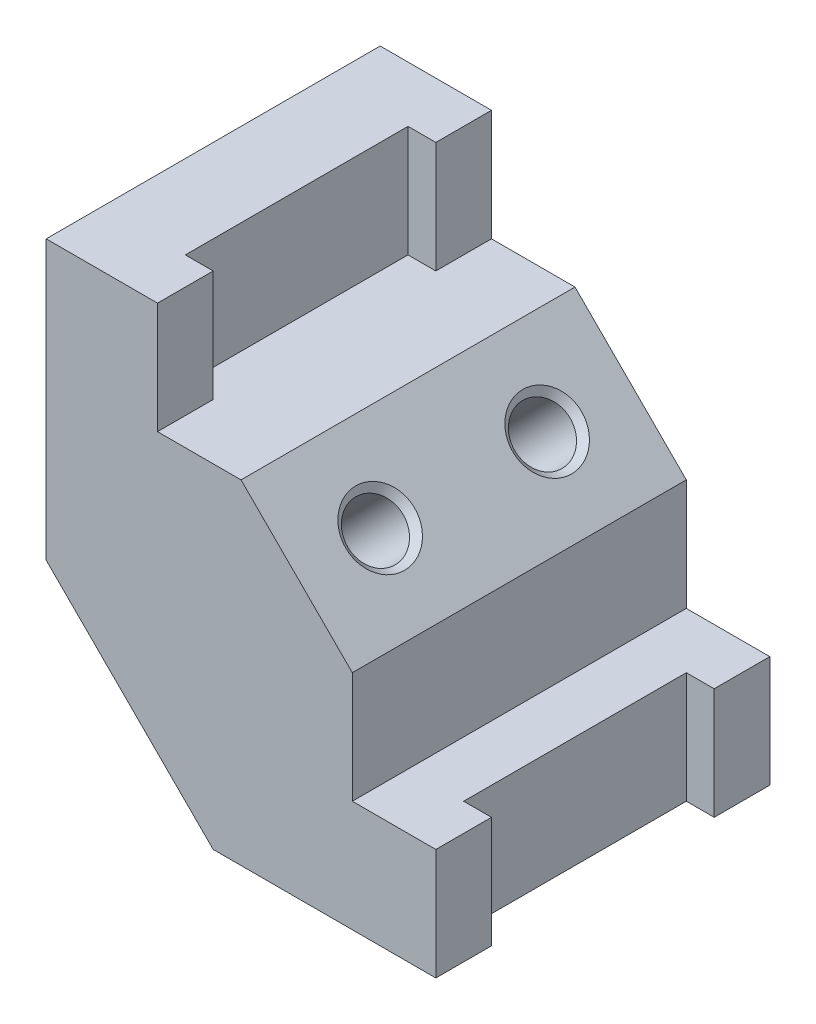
from build123d import *

# Parameters (mm, degrees)
BOSS_EXTRUDE1_DEPTH = 38.1
SKETCH2_R           = 6.35
CUT_EXTRUDE1_DEPTH  = 142.777171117
SKETCH4_W           = 6.35
SKETCH4_H           = 50.8
CUT_EXTRUDE2_DEPTH  = 25.4
SKETCH5_W           = 6.35
SKETCH5_H           = 50.8
CUT_EXTRUDE3_DEPTH  = 124.131068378
CHAMFER1_SIZE       = 1.524


with BuildPart() as part:
    # Sketch1 → Boss-Extrude1 (new, symmetric)
    with BuildSketch(Plane.XY):
        Polygon((25.4, 0), (0, 0), (0, -63.5), (38.1, -101.6), (88.9, -101.6), (88.9, -76.2), (69.85, -76.2), (69.85, -50.8), (44.45, -25.4), (25.4, -25.4), align=None)
    extrude(amount=BOSS_EXTRUDE1_DEPTH, both=True)

    # Sketch2 → Cut-Extrude1 (cut, through all)
    with BuildSketch(Plane(origin=(9.525, 9.525, 0), x_dir=(0, 0, -1), z_dir=(0.7071067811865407, 0.7071067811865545, 0))):
        with Locations(Location((-19.05, -67.35463315, 0), (0, 0, 90))):
            Circle(SKETCH2_R)
        with Locations(Location((19.05, -67.35463315, 0), (0, 0, 90))):
            Circle(SKETCH2_R)
    extrude(amount=-CUT_EXTRUDE1_DEPTH, mode=Mode.SUBTRACT)

    # Sketch4 → Cut-Extrude2 (cut)
    with BuildSketch(Plane(origin=(0, 0, 0), x_dir=(1, 0, 0), z_dir=(0, 1, 0))):
        with Locations((22.225, 0)):
            Rectangle(SKETCH4_W, SKETCH4_H)
    extrude(amount=-CUT_EXTRUDE2_DEPTH, mode=Mode.SUBTRACT)

    # Sketch5 → Cut-Extrude3 (cut, through all)
    with BuildSketch(Plane(origin=(0, -76.2, 0), x_dir=(1, 0, 0), z_dir=(0, 1, 0))):
        with Locations((85.725, 0)):
            Rectangle(SKETCH5_W, SKETCH5_H)
    extrude(amount=-CUT_EXTRUDE3_DEPTH, mode=Mode.SUBTRACT)

    # Chamfer1
    chamfer1_edges = [part.edges().sort_by_distance(p)[0] for p in [
        (61.642045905, -42.592045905, 19.05),
        (61.642045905, -42.592045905, -19.05),
    ]]
    chamfer(chamfer1_edges, length=CHAMFER1_SIZE)


solid = part.part
